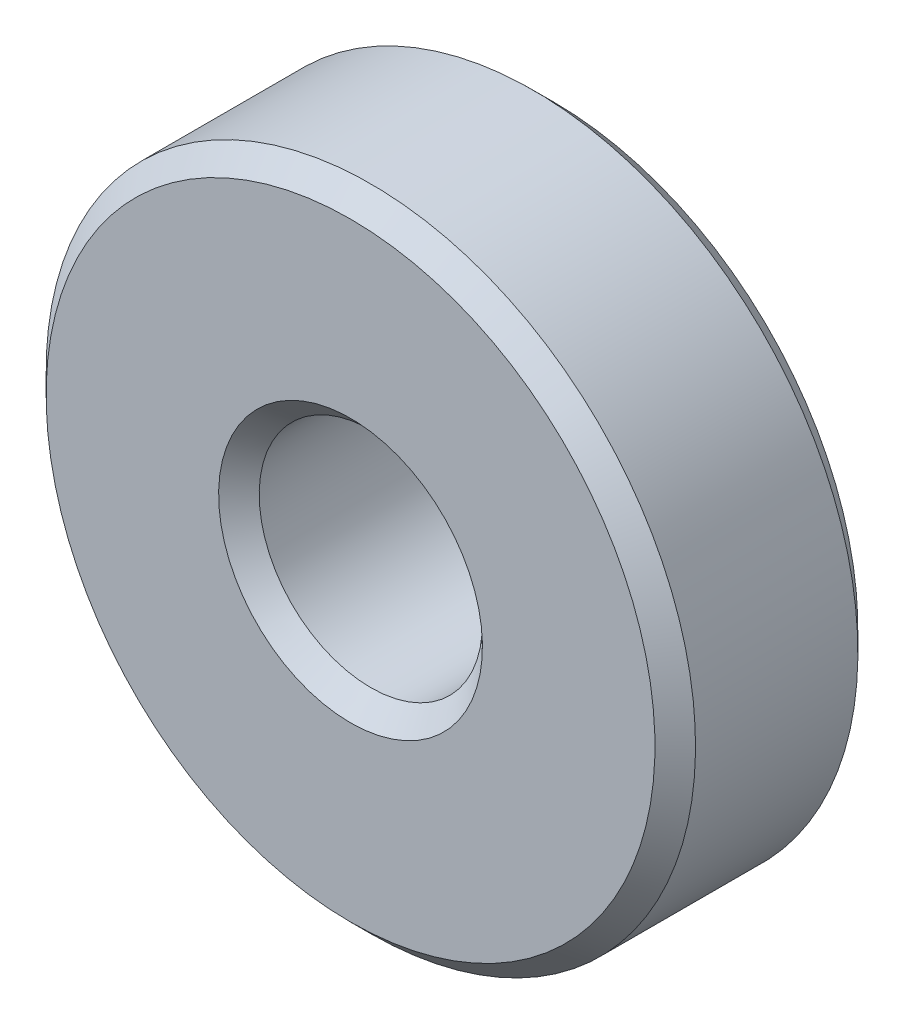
from build123d import *


with BuildPart() as part:
    # Sketch1 → Revolve1 (revolve)
    with BuildSketch(Plane(origin=(0, 0, 0), x_dir=(0, 0, -1), z_dir=(1, 0, 0)), mode=Mode.PRIVATE) as revolve1_sk:
        Polygon((-4.5, 2.75), (-0.5, 2.75), (0, 3.25), (0, 7.5), (-0.5, 8), (-4.5, 8), (-5, 7.5), (-5, 3.25), align=None)
    revolve(revolve1_sk.sketch.rotate(Axis((0, 0, 5), (0, 0, -1)), 180), axis=Axis((0, 0, 5), (0, 0, -1)))


solid = part.part
